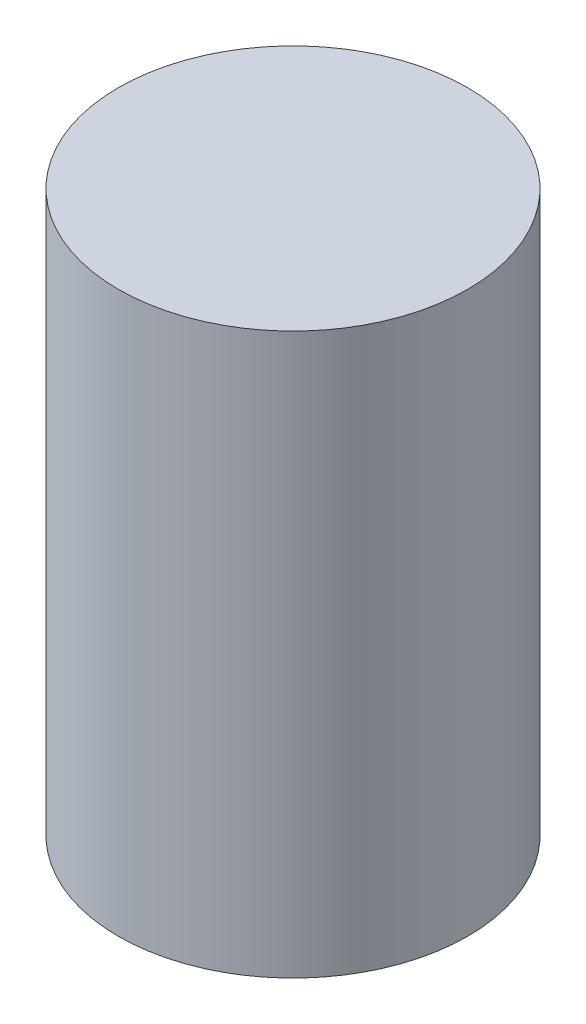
ISO-10303-21;
HEADER;
FILE_DESCRIPTION(('STEP AP214'),'2;1');
FILE_NAME('part.step','',(''),(''),'','','');
FILE_SCHEMA(('AUTOMOTIVE_DESIGN { 1 0 10303 214 1 1 1 1 }'));
ENDSEC;
DATA;
#1=APPLICATION_CONTEXT('core data for automotive mechanical design processes');
#2=APPLICATION_PROTOCOL_DEFINITION('international standard','automotive_design',2000,#1);
#3=PRODUCT_CONTEXT('',#1,'mechanical');
#4=PRODUCT('Part','Part','',(#3));
#5=PRODUCT_RELATED_PRODUCT_CATEGORY('part','',(#4));
#6=PRODUCT_DEFINITION_FORMATION('','',#4);
#7=PRODUCT_DEFINITION_CONTEXT('part definition',#1,'design');
#8=PRODUCT_DEFINITION('design','',#6,#7);
#9=PRODUCT_DEFINITION_SHAPE('','',#8);
#10=(LENGTH_UNIT() NAMED_UNIT(*) SI_UNIT(.MILLI.,.METRE.));
#11=(NAMED_UNIT(*) PLANE_ANGLE_UNIT() SI_UNIT($,.RADIAN.));
#12=(NAMED_UNIT(*) SI_UNIT($,.STERADIAN.) SOLID_ANGLE_UNIT());
#13=UNCERTAINTY_MEASURE_WITH_UNIT(LENGTH_MEASURE(1.E-05),#10,'distance_accuracy_value','');
#14=(GEOMETRIC_REPRESENTATION_CONTEXT(3) GLOBAL_UNCERTAINTY_ASSIGNED_CONTEXT((#13)) GLOBAL_UNIT_ASSIGNED_CONTEXT((#10,
#11,#12)) REPRESENTATION_CONTEXT('',''));
#15=CARTESIAN_POINT('',(0.,0.,0.));
#16=DIRECTION('',(0.,0.,1.));
#17=DIRECTION('',(1.,0.,0.));
#18=AXIS2_PLACEMENT_3D('',#15,#16,#17);
#19=CARTESIAN_POINT('',(0.,2.54635,0.));
#20=DIRECTION('',(0.,-1.,0.));
#21=DIRECTION('',(0.,0.,-1.));
#22=AXIS2_PLACEMENT_3D('',#19,#20,#21);
#23=CYLINDRICAL_SURFACE('',#22,1.5875);
#24=CARTESIAN_POINT('',(0.,2.54635,0.));
#25=DIRECTION('',(0.,1.,0.));
#26=DIRECTION('',(0.,0.,1.));
#27=AXIS2_PLACEMENT_3D('',#24,#25,#26);
#28=CIRCLE('',#27,1.5875);
#29=CARTESIAN_POINT('',(0.,2.54635,1.5875));
#30=VERTEX_POINT('',#29);
#31=EDGE_CURVE('E10',#30,#30,#28,.T.);
#32=ORIENTED_EDGE('',*,*,#31,.F.);
#33=EDGE_LOOP('',(#32));
#34=FACE_BOUND('',#33,.T.);
#35=CARTESIAN_POINT('',(0.,-2.54635,0.));
#36=DIRECTION('',(0.,1.,0.));
#37=DIRECTION('',(0.,0.,1.));
#38=AXIS2_PLACEMENT_3D('',#35,#36,#37);
#39=CIRCLE('',#38,1.5875);
#40=CARTESIAN_POINT('',(0.,-2.54635,1.5875));
#41=VERTEX_POINT('',#40);
#42=EDGE_CURVE('E34',#41,#41,#39,.T.);
#43=ORIENTED_EDGE('',*,*,#42,.T.);
#44=EDGE_LOOP('',(#43));
#45=FACE_BOUND('',#44,.T.);
#46=ADVANCED_FACE('F31',(#34,#45),#23,.T.);
#47=CARTESIAN_POINT('',(0.,2.54635,0.));
#48=DIRECTION('',(0.,1.,0.));
#49=DIRECTION('',(0.,0.,1.));
#50=AXIS2_PLACEMENT_3D('',#47,#48,#49);
#51=PLANE('',#50);
#52=ORIENTED_EDGE('',*,*,#31,.T.);
#53=EDGE_LOOP('',(#52));
#54=FACE_BOUND('',#53,.T.);
#55=ADVANCED_FACE('F46',(#54),#51,.T.);
#56=CARTESIAN_POINT('',(0.,-2.54635,0.));
#57=DIRECTION('',(0.,1.,0.));
#58=DIRECTION('',(0.,0.,1.));
#59=AXIS2_PLACEMENT_3D('',#56,#57,#58);
#60=PLANE('',#59);
#61=ORIENTED_EDGE('',*,*,#42,.F.);
#62=EDGE_LOOP('',(#61));
#63=FACE_BOUND('',#62,.T.);
#64=ADVANCED_FACE('F44',(#63),#60,.F.);
#65=CLOSED_SHELL('',(#46,#55,#64));
#66=MANIFOLD_SOLID_BREP('B2',#65);
#67=ADVANCED_BREP_SHAPE_REPRESENTATION('',(#18,#66),#14);
#68=SHAPE_DEFINITION_REPRESENTATION(#9,#67);
ENDSEC;
END-ISO-10303-21;
